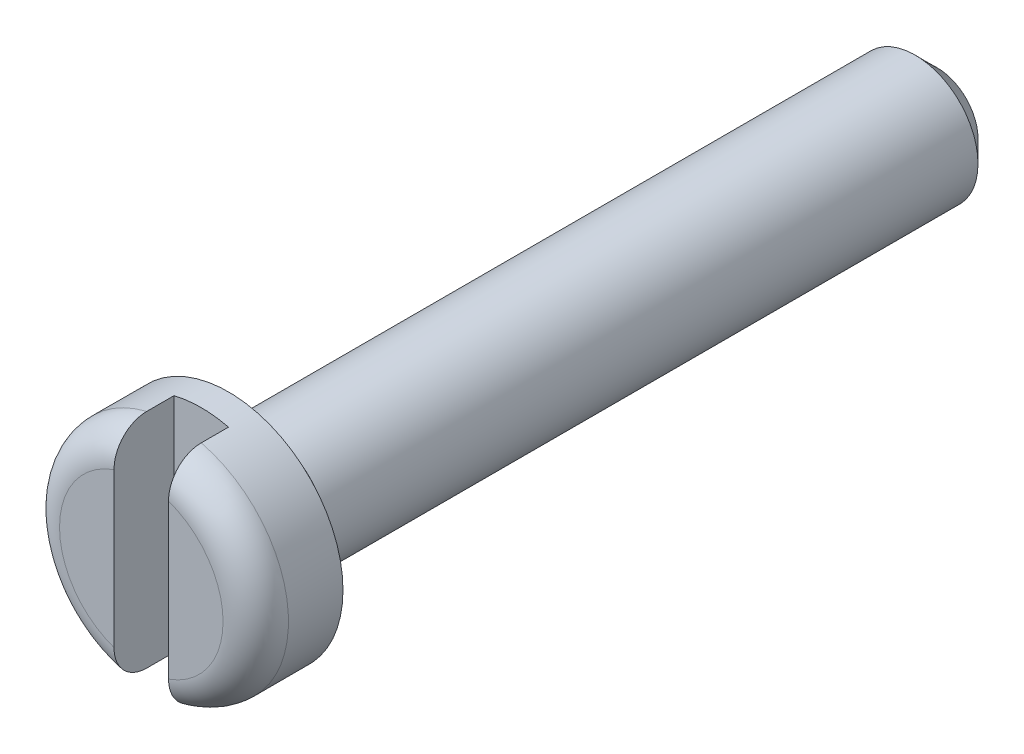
ISO-10303-21;
HEADER;
FILE_DESCRIPTION(('STEP AP214'),'2;1');
FILE_NAME('part.step','',(''),(''),'','','');
FILE_SCHEMA(('AUTOMOTIVE_DESIGN { 1 0 10303 214 1 1 1 1 }'));
ENDSEC;
DATA;
#1=APPLICATION_CONTEXT('core data for automotive mechanical design processes');
#2=APPLICATION_PROTOCOL_DEFINITION('international standard','automotive_design',2000,#1);
#3=PRODUCT_CONTEXT('',#1,'mechanical');
#4=PRODUCT('Part','Part','',(#3));
#5=PRODUCT_RELATED_PRODUCT_CATEGORY('part','',(#4));
#6=PRODUCT_DEFINITION_FORMATION('','',#4);
#7=PRODUCT_DEFINITION_CONTEXT('part definition',#1,'design');
#8=PRODUCT_DEFINITION('design','',#6,#7);
#9=PRODUCT_DEFINITION_SHAPE('','',#8);
#10=(LENGTH_UNIT() NAMED_UNIT(*) SI_UNIT(.MILLI.,.METRE.));
#11=(NAMED_UNIT(*) PLANE_ANGLE_UNIT() SI_UNIT($,.RADIAN.));
#12=(NAMED_UNIT(*) SI_UNIT($,.STERADIAN.) SOLID_ANGLE_UNIT());
#13=UNCERTAINTY_MEASURE_WITH_UNIT(LENGTH_MEASURE(1.E-05),#10,'distance_accuracy_value','');
#14=(GEOMETRIC_REPRESENTATION_CONTEXT(3) GLOBAL_UNCERTAINTY_ASSIGNED_CONTEXT((#13)) GLOBAL_UNIT_ASSIGNED_CONTEXT((#10,
#11,#12)) REPRESENTATION_CONTEXT('',''));
#15=CARTESIAN_POINT('',(0.,0.,0.));
#16=DIRECTION('',(0.,0.,1.));
#17=DIRECTION('',(1.,0.,0.));
#18=AXIS2_PLACEMENT_3D('',#15,#16,#17);
#19=CARTESIAN_POINT('',(0.,0.,1.6));
#20=DIRECTION('',(0.,0.,1.));
#21=DIRECTION('',(1.,0.,0.));
#22=AXIS2_PLACEMENT_3D('',#19,#20,#21);
#23=PLANE('',#22);
#24=DIRECTION('',(0.,-1.,0.));
#25=VECTOR('',#24,1.);
#26=CARTESIAN_POINT('',(-0.5,0.,1.6));
#27=LINE('',#26,#25);
#28=CARTESIAN_POINT('',(-0.5,1.4142135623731,1.6));
#29=VERTEX_POINT('',#28);
#30=CARTESIAN_POINT('',(-0.5,-1.4142135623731,1.6));
#31=VERTEX_POINT('',#30);
#32=EDGE_CURVE('E97',#29,#31,#27,.T.);
#33=ORIENTED_EDGE('',*,*,#32,.F.);
#34=CARTESIAN_POINT('',(0.,0.,1.6));
#35=DIRECTION('',(0.,0.,1.));
#36=DIRECTION('',(1.,0.,0.));
#37=AXIS2_PLACEMENT_3D('',#34,#35,#36);
#38=CIRCLE('',#37,1.5);
#39=EDGE_CURVE('E121',#29,#31,#38,.T.);
#40=ORIENTED_EDGE('',*,*,#39,.T.);
#41=EDGE_LOOP('',(#33,#40));
#42=FACE_BOUND('',#41,.T.);
#43=ADVANCED_FACE('F26',(#42),#23,.T.);
#44=CARTESIAN_POINT('',(0.,0.,1.));
#45=DIRECTION('',(0.,0.,1.));
#46=DIRECTION('',(1.,0.,0.));
#47=AXIS2_PLACEMENT_3D('',#44,#45,#46);
#48=TOROIDAL_SURFACE('',#47,1.5,0.6);
#49=CARTESIAN_POINT('',(-0.5,-1.99964689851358,1.21223347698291));
#50=CARTESIAN_POINT('',(-0.5,-2.01156673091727,1.18165302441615));
#51=CARTESIAN_POINT('',(-0.5,-2.02092214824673,1.15006159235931));
#52=CARTESIAN_POINT('',(-0.5,-2.03420012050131,1.08574395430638));
#53=CARTESIAN_POINT('',(-0.5,-2.03811994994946,1.05301718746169));
#54=CARTESIAN_POINT('',(-0.5,-2.04039563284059,0.987371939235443));
#55=CARTESIAN_POINT('',(-0.5,-2.03875192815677,0.954453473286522));
#56=CARTESIAN_POINT('',(-0.5,-2.02995378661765,0.889365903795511));
#57=CARTESIAN_POINT('',(-0.5,-2.02279989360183,0.857196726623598));
#58=CARTESIAN_POINT('',(-0.5,-2.00321865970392,0.794539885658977));
#59=CARTESIAN_POINT('',(-0.5,-1.99079615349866,0.764050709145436));
#60=CARTESIAN_POINT('',(-0.5,-1.96106630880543,0.705557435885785));
#61=CARTESIAN_POINT('',(-0.5,-1.94375877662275,0.677553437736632));
#62=CARTESIAN_POINT('',(-0.5,-1.90455349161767,0.6244526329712));
#63=CARTESIAN_POINT('',(-0.5,-1.88260363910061,0.599394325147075));
#64=CARTESIAN_POINT('',(-0.5,-1.83490308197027,0.553207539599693));
#65=CARTESIAN_POINT('',(-0.5,-1.80915201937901,0.532079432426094));
#66=CARTESIAN_POINT('',(-0.5,-1.75389034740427,0.493752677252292));
#67=CARTESIAN_POINT('',(-0.5,-1.7243002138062,0.476668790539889));
#68=CARTESIAN_POINT('',(-0.5,-1.66275438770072,0.447501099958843));
#69=CARTESIAN_POINT('',(-0.5,-1.63079832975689,0.435418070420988));
#70=CARTESIAN_POINT('',(-0.5,-1.56410675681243,0.416073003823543));
#71=CARTESIAN_POINT('',(-0.5,-1.52931144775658,0.409017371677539));
#72=CARTESIAN_POINT('',(-0.5,-1.45904380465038,0.400550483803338));
#73=CARTESIAN_POINT('',(-0.5,-1.42357131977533,0.399140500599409));
#74=CARTESIAN_POINT('',(-0.5,-1.35108451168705,0.401927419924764));
#75=CARTESIAN_POINT('',(-0.5,-1.31408104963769,0.406406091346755));
#76=CARTESIAN_POINT('',(-0.5,-1.24126423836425,0.421208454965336));
#77=CARTESIAN_POINT('',(-0.5,-1.20545115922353,0.431533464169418));
#78=CARTESIAN_POINT('',(-0.5,-1.13417944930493,0.458325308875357));
#79=CARTESIAN_POINT('',(-0.5,-1.09882466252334,0.475068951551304));
#80=CARTESIAN_POINT('',(-0.5,-1.0313298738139,0.514163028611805));
#81=CARTESIAN_POINT('',(-0.5,-0.999192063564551,0.536517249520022));
#82=CARTESIAN_POINT('',(-0.5,-0.938652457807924,0.586745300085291));
#83=CARTESIAN_POINT('',(-0.5,-0.91031989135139,0.614702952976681));
#84=CARTESIAN_POINT('',(-0.5,-0.859233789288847,0.675318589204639));
#85=CARTESIAN_POINT('',(-0.5,-0.836472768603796,0.707970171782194));
#86=CARTESIAN_POINT('',(-0.5,-0.802490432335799,0.768994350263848));
#87=CARTESIAN_POINT('',(-0.5,-0.789813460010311,0.796558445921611));
#88=CARTESIAN_POINT('',(-0.5,-0.769222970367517,0.853407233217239));
#89=CARTESIAN_POINT('',(-0.5,-0.761304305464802,0.882690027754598));
#90=CARTESIAN_POINT('',(-0.5,-0.750757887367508,0.942341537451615));
#91=CARTESIAN_POINT('',(-0.5,-0.74815377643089,0.972714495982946));
#92=CARTESIAN_POINT('',(-0.5,-0.748528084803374,1.03342787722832));
#93=CARTESIAN_POINT('',(-0.5,-0.751506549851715,1.06376829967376));
#94=CARTESIAN_POINT('',(-0.5,-0.762394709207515,1.12132246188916));
#95=CARTESIAN_POINT('',(-0.5,-0.769943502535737,1.14860616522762));
#96=CARTESIAN_POINT('',(-0.5,-0.789179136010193,1.20166601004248));
#97=CARTESIAN_POINT('',(-0.5,-0.800867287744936,1.22744167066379));
#98=CARTESIAN_POINT('',(-0.5,-0.82889681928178,1.27899767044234));
#99=CARTESIAN_POINT('',(-0.5,-0.845533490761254,1.30461659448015));
#100=CARTESIAN_POINT('',(-0.5,-0.882315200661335,1.35319089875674));
#101=CARTESIAN_POINT('',(-0.5,-0.902461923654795,1.37614499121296));
#102=CARTESIAN_POINT('',(-0.5,-0.949067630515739,1.42246367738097));
#103=CARTESIAN_POINT('',(-0.5,-0.976021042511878,1.44533169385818));
#104=CARTESIAN_POINT('',(-0.5,-1.03306909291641,1.48674639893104));
#105=CARTESIAN_POINT('',(-0.5,-1.0631653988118,1.50529077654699));
#106=CARTESIAN_POINT('',(-0.5,-1.1291001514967,1.53941199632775));
#107=CARTESIAN_POINT('',(-0.5,-1.16520935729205,1.55446871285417));
#108=CARTESIAN_POINT('',(-0.5,-1.23942611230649,1.57840607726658));
#109=CARTESIAN_POINT('',(-0.5,-1.27753394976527,1.58728583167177));
#110=CARTESIAN_POINT('',(-0.5,-1.35523785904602,1.59856860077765));
#111=CARTESIAN_POINT('',(-0.5,-1.39484711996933,1.60088192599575));
#112=CARTESIAN_POINT('',(-0.5,-1.47386106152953,1.59851603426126));
#113=CARTESIAN_POINT('',(-0.5,-1.51326578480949,1.59383833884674));
#114=CARTESIAN_POINT('',(-0.5,-1.58894762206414,1.57778917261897));
#115=CARTESIAN_POINT('',(-0.5,-1.62528651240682,1.56670972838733));
#116=CARTESIAN_POINT('',(-0.5,-1.69542326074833,1.5382626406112));
#117=CARTESIAN_POINT('',(-0.5,-1.72922156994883,1.52089611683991));
#118=CARTESIAN_POINT('',(-0.5,-1.79139186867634,1.48138259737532));
#119=CARTESIAN_POINT('',(-0.5,-1.81995682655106,1.45953887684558));
#120=CARTESIAN_POINT('',(-0.5,-1.87278431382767,1.41117493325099));
#121=CARTESIAN_POINT('',(-0.5,-1.89705092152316,1.38465919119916));
#122=CARTESIAN_POINT('',(-0.5,-1.93549452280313,1.33423884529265));
#123=CARTESIAN_POINT('',(-0.5,-1.95071039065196,1.31111809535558));
#124=CARTESIAN_POINT('',(-0.5,-1.97777146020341,1.26298118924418));
#125=CARTESIAN_POINT('',(-0.5,-1.9896170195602,1.23796523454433));
#126=CARTESIAN_POINT('',(-0.5,-1.99964689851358,1.21223347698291));
#127=B_SPLINE_CURVE_WITH_KNOTS('',3,(#49,#50,#51,#52,#53,#54,#55,#56,#57,#58,#59,#60,#61,#62,
#63,#64,#65,#66,#67,#68,#69,#70,#71,#72,#73,#74,#75,#76,#77,#78,#79,#80,#81,#82,#83,#84,#85,#86,
#87,#88,#89,#90,#91,#92,#93,#94,#95,#96,#97,#98,#99,#100,#101,#102,#103,#104,#105,#106,#107,
#108,#109,#110,#111,#112,#113,#114,#115,#116,#117,#118,#119,#120,#121,#122,#123,#124,#125,#126),
.UNSPECIFIED.,.T.,.F.,(4,2,2,2,2,2,2,2,2,2,2,2,2,2,2,2,2,2,2,2,2,2,2,2,2,2,2,2,2,2,2,2,2,2,2,2,
2,2,4),(0.,0.0983660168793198,0.196781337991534,0.295188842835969,0.393586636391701,
0.491894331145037,0.590205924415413,0.689685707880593,0.789174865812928,0.89121730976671,
0.993275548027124,1.09931419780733,1.20537674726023,1.31670366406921,1.42805566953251,
1.54487799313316,1.66177937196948,1.78058119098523,1.89922251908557,1.98986685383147,
2.08041295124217,2.17136098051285,2.26230975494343,2.34687306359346,2.4314631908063,
2.52275501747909,2.61409077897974,2.71970201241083,2.8253695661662,2.94219498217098,
3.05903729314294,3.17746802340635,3.29587298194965,3.4092608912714,3.52262861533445,
3.62996855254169,3.73720609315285,3.8199844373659,3.90275399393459),.UNSPECIFIED.);
#128=CARTESIAN_POINT('',(-0.5,-2.03960780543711,1.));
#129=VERTEX_POINT('',#128);
#130=EDGE_CURVE('E49',#31,#129,#127,.T.);
#131=ORIENTED_EDGE('',*,*,#130,.F.);
#132=ORIENTED_EDGE('',*,*,#39,.F.);
#133=CARTESIAN_POINT('',(-0.5,0.772599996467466,1.15466697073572));
#134=CARTESIAN_POINT('',(-0.5,0.763899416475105,1.12728531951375));
#135=CARTESIAN_POINT('',(-0.5,0.757412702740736,1.09919049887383));
#136=CARTESIAN_POINT('',(-0.5,0.749307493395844,1.04230286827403));
#137=CARTESIAN_POINT('',(-0.5,0.747687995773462,1.01351020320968));
#138=CARTESIAN_POINT('',(-0.5,0.749438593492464,0.956074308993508));
#139=CARTESIAN_POINT('',(-0.5,0.752809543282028,0.927431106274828));
#140=CARTESIAN_POINT('',(-0.5,0.764293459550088,0.871113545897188));
#141=CARTESIAN_POINT('',(-0.5,0.772408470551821,0.843439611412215));
#142=CARTESIAN_POINT('',(-0.5,0.792942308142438,0.789539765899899));
#143=CARTESIAN_POINT('',(-0.5,0.805390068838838,0.763324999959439));
#144=CARTESIAN_POINT('',(-0.5,0.833977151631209,0.713002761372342));
#145=CARTESIAN_POINT('',(-0.5,0.850117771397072,0.688896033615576));
#146=CARTESIAN_POINT('',(-0.5,0.888019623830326,0.639886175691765));
#147=CARTESIAN_POINT('',(-0.5,0.910252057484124,0.615347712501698));
#148=CARTESIAN_POINT('',(-0.5,0.958060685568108,0.569779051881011));
#149=CARTESIAN_POINT('',(-0.5,0.983638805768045,0.548750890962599));
#150=CARTESIAN_POINT('',(-0.5,1.04127151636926,0.507845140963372));
#151=CARTESIAN_POINT('',(-0.5,1.07373186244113,0.488536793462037));
#152=CARTESIAN_POINT('',(-0.5,1.14130979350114,0.455312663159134));
#153=CARTESIAN_POINT('',(-0.5,1.17642828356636,0.441398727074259));
#154=CARTESIAN_POINT('',(-0.5,1.25038064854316,0.418775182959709));
#155=CARTESIAN_POINT('',(-0.5,1.28931277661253,0.410384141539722));
#156=CARTESIAN_POINT('',(-0.5,1.36804626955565,0.400426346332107));
#157=CARTESIAN_POINT('',(-0.5,1.4078475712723,0.398859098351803));
#158=CARTESIAN_POINT('',(-0.5,1.4861656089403,0.402738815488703));
#159=CARTESIAN_POINT('',(-0.5,1.52469038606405,0.408019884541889));
#160=CARTESIAN_POINT('',(-0.5,1.60019331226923,0.425342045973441));
#161=CARTESIAN_POINT('',(-0.5,1.63717190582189,0.43738118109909));
#162=CARTESIAN_POINT('',(-0.5,1.70644533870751,0.467196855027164));
#163=CARTESIAN_POINT('',(-0.5,1.7388841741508,0.484638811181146));
#164=CARTESIAN_POINT('',(-0.5,1.80016448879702,0.524989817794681));
#165=CARTESIAN_POINT('',(-0.5,1.8290070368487,0.547897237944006));
#166=CARTESIAN_POINT('',(-0.5,1.88077906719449,0.597293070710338));
#167=CARTESIAN_POINT('',(-0.5,1.903929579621,0.623549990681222));
#168=CARTESIAN_POINT('',(-0.5,1.94529912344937,0.679698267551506));
#169=CARTESIAN_POINT('',(-0.5,1.96351923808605,0.709588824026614));
#170=CARTESIAN_POINT('',(-0.5,1.99385821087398,0.771009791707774));
#171=CARTESIAN_POINT('',(-0.5,2.00616950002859,0.802445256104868));
#172=CARTESIAN_POINT('',(-0.5,2.02521830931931,0.866961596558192));
#173=CARTESIAN_POINT('',(-0.5,2.03195656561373,0.900042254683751));
#174=CARTESIAN_POINT('',(-0.5,2.0395595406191,0.966200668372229));
#175=CARTESIAN_POINT('',(-0.5,2.04053875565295,0.999265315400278));
#176=CARTESIAN_POINT('',(-0.5,2.03689912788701,1.06508385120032));
#177=CARTESIAN_POINT('',(-0.5,2.03228058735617,1.09783775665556));
#178=CARTESIAN_POINT('',(-0.5,2.01763364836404,1.16192635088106));
#179=CARTESIAN_POINT('',(-0.5,2.00763426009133,1.19326768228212));
#180=CARTESIAN_POINT('',(-0.5,1.98255923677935,1.25384696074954));
#181=CARTESIAN_POINT('',(-0.5,1.96748352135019,1.28308487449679));
#182=CARTESIAN_POINT('',(-0.5,1.93256863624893,1.33891428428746));
#183=CARTESIAN_POINT('',(-0.5,1.91268930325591,1.36548063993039));
#184=CARTESIAN_POINT('',(-0.5,1.86884253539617,1.41498884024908));
#185=CARTESIAN_POINT('',(-0.5,1.84487477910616,1.43793039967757));
#186=CARTESIAN_POINT('',(-0.5,1.79297405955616,1.48010891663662));
#187=CARTESIAN_POINT('',(-0.5,1.76496410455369,1.49925105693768));
#188=CARTESIAN_POINT('',(-0.5,1.70621840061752,1.53274771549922));
#189=CARTESIAN_POINT('',(-0.5,1.6754822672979,1.547101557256));
#190=CARTESIAN_POINT('',(-0.5,1.61098629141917,1.57118610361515));
#191=CARTESIAN_POINT('',(-0.5,1.5771574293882,1.58073177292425));
#192=CARTESIAN_POINT('',(-0.5,1.50841164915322,1.59428924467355));
#193=CARTESIAN_POINT('',(-0.5,1.47349450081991,1.59829986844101));
#194=CARTESIAN_POINT('',(-0.5,1.40179301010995,1.60088611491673));
#195=CARTESIAN_POINT('',(-0.5,1.364999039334,1.59919340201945));
#196=CARTESIAN_POINT('',(-0.5,1.29215404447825,1.58997004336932));
#197=CARTESIAN_POINT('',(-0.5,1.25610316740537,1.58243825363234));
#198=CARTESIAN_POINT('',(-0.5,1.18382026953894,1.56130965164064));
#199=CARTESIAN_POINT('',(-0.5,1.14767284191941,1.54742301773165));
#200=CARTESIAN_POINT('',(-0.5,1.07809474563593,1.51394463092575));
#201=CARTESIAN_POINT('',(-0.5,1.04466605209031,1.49434877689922));
#202=CARTESIAN_POINT('',(-0.5,0.980565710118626,1.44927309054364));
#203=CARTESIAN_POINT('',(-0.5,0.950002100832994,1.42363913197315));
#204=CARTESIAN_POINT('',(-0.5,0.893903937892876,1.36737392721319));
#205=CARTESIAN_POINT('',(-0.5,0.868362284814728,1.33674984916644));
#206=CARTESIAN_POINT('',(-0.5,0.830295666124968,1.28098262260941));
#207=CARTESIAN_POINT('',(-0.5,0.816160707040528,1.25693018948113));
#208=CARTESIAN_POINT('',(-0.5,0.791526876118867,1.2070295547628));
#209=CARTESIAN_POINT('',(-0.5,0.7810254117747,1.18118264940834));
#210=CARTESIAN_POINT('',(-0.5,0.772599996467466,1.15466697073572));
#211=B_SPLINE_CURVE_WITH_KNOTS('',3,(#133,#134,#135,#136,#137,#138,#139,#140,#141,#142,#143,
#144,#145,#146,#147,#148,#149,#150,#151,#152,#153,#154,#155,#156,#157,#158,#159,#160,#161,#162,
#163,#164,#165,#166,#167,#168,#169,#170,#171,#172,#173,#174,#175,#176,#177,#178,#179,#180,#181,
#182,#183,#184,#185,#186,#187,#188,#189,#190,#191,#192,#193,#194,#195,#196,#197,#198,#199,#200,
#201,#202,#203,#204,#205,#206,#207,#208,#209,#210),.UNSPECIFIED.,.T.,.F.,(4,2,2,2,2,2,2,2,2,2,2,
2,2,2,2,2,2,2,2,2,2,2,2,2,2,2,2,2,2,2,2,2,2,2,2,2,2,2,4),(0.,0.0861004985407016,
0.172183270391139,0.258280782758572,0.344415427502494,0.431136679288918,0.517888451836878,
0.616838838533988,0.715846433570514,0.828658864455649,0.94150988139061,1.06040365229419,
1.17928881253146,1.29534715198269,1.41137189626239,1.52130225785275,1.63119986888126,
1.73569320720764,1.84016356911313,1.94095132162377,2.04172575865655,2.14048972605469,
2.23924836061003,2.33747980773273,2.43571281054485,2.5347974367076,2.63388985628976,
2.73520870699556,2.83654186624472,2.94152301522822,3.0465265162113,3.1565379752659,
3.26657099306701,3.38221768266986,3.49794765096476,3.61703308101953,3.7359489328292,
3.81938607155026,3.90276355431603),.UNSPECIFIED.);
#212=CARTESIAN_POINT('',(-0.5,2.03960780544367,0.999999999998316));
#213=VERTEX_POINT('',#212);
#214=EDGE_CURVE('E158',#213,#29,#211,.T.);
#215=ORIENTED_EDGE('',*,*,#214,.F.);
#216=CARTESIAN_POINT('',(0.,0.,1.));
#217=DIRECTION('',(0.,0.,1.));
#218=DIRECTION('',(1.,0.,0.));
#219=AXIS2_PLACEMENT_3D('',#216,#217,#218);
#220=CIRCLE('',#219,2.1);
#221=EDGE_CURVE('E123',#129,#213,#220,.F.);
#222=ORIENTED_EDGE('',*,*,#221,.F.);
#223=EDGE_LOOP('',(#131,#132,#215,#222));
#224=FACE_BOUND('',#223,.T.);
#225=ADVANCED_FACE('F173',(#224),#48,.T.);
#226=CARTESIAN_POINT('',(0.,0.,0.));
#227=DIRECTION('',(0.,0.,1.));
#228=DIRECTION('',(1.,0.,0.));
#229=AXIS2_PLACEMENT_3D('',#226,#227,#228);
#230=PLANE('',#229);
#231=CARTESIAN_POINT('',(0.,0.,0.));
#232=DIRECTION('',(0.,0.,1.));
#233=DIRECTION('',(1.,0.,0.));
#234=AXIS2_PLACEMENT_3D('',#231,#232,#233);
#235=CIRCLE('',#234,2.1);
#236=CARTESIAN_POINT('',(2.1,0.,0.));
#237=VERTEX_POINT('',#236);
#238=EDGE_CURVE('E115',#237,#237,#235,.T.);
#239=ORIENTED_EDGE('',*,*,#238,.F.);
#240=EDGE_LOOP('',(#239));
#241=FACE_BOUND('',#240,.T.);
#242=CARTESIAN_POINT('',(0.,0.,0.));
#243=DIRECTION('',(0.,0.,1.));
#244=DIRECTION('',(1.,0.,0.));
#245=AXIS2_PLACEMENT_3D('',#242,#243,#244);
#246=CIRCLE('',#245,0.749999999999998);
#247=CARTESIAN_POINT('',(0.749999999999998,0.,0.));
#248=VERTEX_POINT('',#247);
#249=EDGE_CURVE('E108',#248,#248,#246,.T.);
#250=ORIENTED_EDGE('',*,*,#249,.T.);
#251=EDGE_LOOP('',(#250));
#252=FACE_BOUND('',#251,.T.);
#253=ADVANCED_FACE('F182',(#241,#252),#230,.F.);
#254=CARTESIAN_POINT('',(0.,0.,1.6));
#255=DIRECTION('',(0.,0.,-1.));
#256=DIRECTION('',(-1.,0.,0.));
#257=AXIS2_PLACEMENT_3D('',#254,#255,#256);
#258=CYLINDRICAL_SURFACE('',#257,2.1);
#259=CARTESIAN_POINT('',(0.,0.,0.5));
#260=DIRECTION('',(0.,0.,-1.));
#261=DIRECTION('',(-1.,0.,0.));
#262=AXIS2_PLACEMENT_3D('',#259,#260,#261);
#263=CIRCLE('',#262,2.1);
#264=CARTESIAN_POINT('',(0.499999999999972,-2.03960780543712,0.5));
#265=VERTEX_POINT('',#264);
#266=CARTESIAN_POINT('',(-0.5,-2.03960780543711,0.5));
#267=VERTEX_POINT('',#266);
#268=EDGE_CURVE('E11',#265,#267,#263,.T.);
#269=ORIENTED_EDGE('',*,*,#268,.T.);
#270=DIRECTION('',(0.,0.,-1.));
#271=VECTOR('',#270,1.);
#272=CARTESIAN_POINT('',(-0.5,-2.03960780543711,1.6));
#273=LINE('',#272,#271);
#274=EDGE_CURVE('E106',#267,#129,#273,.F.);
#275=ORIENTED_EDGE('',*,*,#274,.T.);
#276=ORIENTED_EDGE('',*,*,#221,.T.);
#277=DIRECTION('',(0.,0.,-1.));
#278=VECTOR('',#277,1.);
#279=CARTESIAN_POINT('',(-0.5,2.03960780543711,1.6));
#280=LINE('',#279,#278);
#281=CARTESIAN_POINT('',(-0.5,2.03960780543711,0.5));
#282=VERTEX_POINT('',#281);
#283=EDGE_CURVE('E99',#213,#282,#280,.T.);
#284=ORIENTED_EDGE('',*,*,#283,.T.);
#285=CARTESIAN_POINT('',(0.499999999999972,2.03960780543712,0.5));
#286=VERTEX_POINT('',#285);
#287=EDGE_CURVE('E30',#282,#286,#263,.T.);
#288=ORIENTED_EDGE('',*,*,#287,.T.);
#289=DIRECTION('',(0.,0.,-1.));
#290=VECTOR('',#289,1.);
#291=CARTESIAN_POINT('',(0.499999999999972,2.03960780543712,1.6));
#292=LINE('',#291,#290);
#293=CARTESIAN_POINT('',(0.499999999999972,2.0396078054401,1.00000000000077));
#294=VERTEX_POINT('',#293);
#295=EDGE_CURVE('E91',#286,#294,#292,.F.);
#296=ORIENTED_EDGE('',*,*,#295,.T.);
#297=CARTESIAN_POINT('',(0.499999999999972,-2.03960780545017,1.00000000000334));
#298=VERTEX_POINT('',#297);
#299=EDGE_CURVE('E96',#294,#298,#220,.F.);
#300=ORIENTED_EDGE('',*,*,#299,.T.);
#301=DIRECTION('',(0.,0.,-1.));
#302=VECTOR('',#301,1.);
#303=CARTESIAN_POINT('',(0.499999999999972,-2.03960780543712,1.6));
#304=LINE('',#303,#302);
#305=EDGE_CURVE('E88',#298,#265,#304,.T.);
#306=ORIENTED_EDGE('',*,*,#305,.T.);
#307=EDGE_LOOP('',(#269,#275,#276,#284,#288,#296,#300,#306));
#308=FACE_BOUND('',#307,.T.);
#309=ORIENTED_EDGE('',*,*,#238,.T.);
#310=EDGE_LOOP('',(#309));
#311=FACE_BOUND('',#310,.T.);
#312=ADVANCED_FACE('F28',(#308,#311),#258,.T.);
#313=DIRECTION('',(0.,1.,0.));
#314=VECTOR('',#313,1.);
#315=CARTESIAN_POINT('',(0.499999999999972,0.,1.6));
#316=LINE('',#315,#314);
#317=CARTESIAN_POINT('',(0.499999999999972,-1.41421356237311,1.6));
#318=VERTEX_POINT('',#317);
#319=CARTESIAN_POINT('',(0.499999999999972,1.41421356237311,1.6));
#320=VERTEX_POINT('',#319);
#321=EDGE_CURVE('E41',#318,#320,#316,.T.);
#322=ORIENTED_EDGE('',*,*,#321,.F.);
#323=EDGE_CURVE('E118',#318,#320,#38,.T.);
#324=ORIENTED_EDGE('',*,*,#323,.T.);
#325=EDGE_LOOP('',(#322,#324));
#326=FACE_BOUND('',#325,.T.);
#327=ADVANCED_FACE('F168',(#326),#23,.T.);
#328=CARTESIAN_POINT('',(0.499999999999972,-1.99964689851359,1.21223347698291));
#329=CARTESIAN_POINT('',(0.499999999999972,-1.98743987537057,1.24354459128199));
#330=CARTESIAN_POINT('',(0.499999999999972,-1.97253379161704,1.27382239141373));
#331=CARTESIAN_POINT('',(0.499999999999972,-1.93780309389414,1.33143351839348));
#332=CARTESIAN_POINT('',(0.499999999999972,-1.9179739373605,1.35876409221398));
#333=CARTESIAN_POINT('',(0.499999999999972,-1.87405915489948,1.40968880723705));
#334=CARTESIAN_POINT('',(0.499999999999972,-1.84997959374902,1.43328818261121));
#335=CARTESIAN_POINT('',(0.499999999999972,-1.79828051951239,1.47620474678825));
#336=CARTESIAN_POINT('',(0.499999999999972,-1.77066148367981,1.49552251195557));
#337=CARTESIAN_POINT('',(0.499999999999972,-1.7120482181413,1.52982219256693));
#338=CARTESIAN_POINT('',(0.499999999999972,-1.68099392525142,1.54470133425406));
#339=CARTESIAN_POINT('',(0.499999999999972,-1.61689891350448,1.56926953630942));
#340=CARTESIAN_POINT('',(0.499999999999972,-1.58385781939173,1.57895761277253));
#341=CARTESIAN_POINT('',(0.499999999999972,-1.51525349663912,1.59331938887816));
#342=CARTESIAN_POINT('',(0.499999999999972,-1.47964263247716,1.5977651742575));
#343=CARTESIAN_POINT('',(0.499999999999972,-1.40817028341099,1.60092494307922));
#344=CARTESIAN_POINT('',(0.499999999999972,-1.3723087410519,1.59963756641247));
#345=CARTESIAN_POINT('',(0.499999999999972,-1.29940747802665,1.59129248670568));
#346=CARTESIAN_POINT('',(0.499999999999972,-1.2624010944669,1.58394350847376));
#347=CARTESIAN_POINT('',(0.499999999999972,-1.19004120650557,1.56341749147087));
#348=CARTESIAN_POINT('',(0.499999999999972,-1.15468811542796,1.55023900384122));
#349=CARTESIAN_POINT('',(0.499999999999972,-1.08496478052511,1.51771878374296));
#350=CARTESIAN_POINT('',(0.499999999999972,-1.05071211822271,1.49812429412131));
#351=CARTESIAN_POINT('',(0.499999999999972,-0.985940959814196,1.45345777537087));
#352=CARTESIAN_POINT('',(0.499999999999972,-0.955425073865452,1.42838195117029));
#353=CARTESIAN_POINT('',(0.499999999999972,-0.899227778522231,1.37328702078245));
#354=CARTESIAN_POINT('',(0.499999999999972,-0.873544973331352,1.343269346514));
#355=CARTESIAN_POINT('',(0.499999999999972,-0.828311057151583,1.27893305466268));
#356=CARTESIAN_POINT('',(0.499999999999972,-0.808748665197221,1.24462251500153));
#357=CARTESIAN_POINT('',(0.499999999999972,-0.781215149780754,1.18183443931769));
#358=CARTESIAN_POINT('',(0.499999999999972,-0.771561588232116,1.15409131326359));
#359=CARTESIAN_POINT('',(0.499999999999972,-0.757044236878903,1.09738531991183));
#360=CARTESIAN_POINT('',(0.499999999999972,-0.752175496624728,1.06842374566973));
#361=CARTESIAN_POINT('',(0.499999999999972,-0.747573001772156,1.01001561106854));
#362=CARTESIAN_POINT('',(0.499999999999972,-0.747852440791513,0.980567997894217));
#363=CARTESIAN_POINT('',(0.499999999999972,-0.753556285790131,0.922172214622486));
#364=CARTESIAN_POINT('',(0.499999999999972,-0.758982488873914,0.893224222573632));
#365=CARTESIAN_POINT('',(0.499999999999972,-0.774320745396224,0.83760124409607));
#366=CARTESIAN_POINT('',(0.499999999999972,-0.784077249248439,0.810882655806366));
#367=CARTESIAN_POINT('',(0.499999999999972,-0.807486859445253,0.759220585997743));
#368=CARTESIAN_POINT('',(0.499999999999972,-0.821141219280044,0.734277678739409));
#369=CARTESIAN_POINT('',(0.499999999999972,-0.853512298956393,0.683857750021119));
#370=CARTESIAN_POINT('',(0.499999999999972,-0.872625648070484,0.658636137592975));
#371=CARTESIAN_POINT('',(0.499999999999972,-0.91428764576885,0.611215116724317));
#372=CARTESIAN_POINT('',(0.499999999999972,-0.936838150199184,0.589017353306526));
#373=CARTESIAN_POINT('',(0.499999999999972,-0.988450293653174,0.544789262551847));
#374=CARTESIAN_POINT('',(0.499999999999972,-1.01798027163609,0.523303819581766));
#375=CARTESIAN_POINT('',(0.499999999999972,-1.08000274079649,0.48513885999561));
#376=CARTESIAN_POINT('',(0.499999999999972,-1.11249658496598,0.468461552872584));
#377=CARTESIAN_POINT('',(0.499999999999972,-1.18244746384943,0.43913396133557));
#378=CARTESIAN_POINT('',(0.499999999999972,-1.22009278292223,0.426929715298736));
#379=CARTESIAN_POINT('',(0.499999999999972,-1.2969086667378,0.409044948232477));
#380=CARTESIAN_POINT('',(0.499999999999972,-1.33607929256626,0.403364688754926));
#381=CARTESIAN_POINT('',(0.499999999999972,-1.41461638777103,0.39886821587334));
#382=CARTESIAN_POINT('',(0.499999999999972,-1.45398075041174,0.40001613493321));
#383=CARTESIAN_POINT('',(0.499999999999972,-1.53189117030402,0.409254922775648));
#384=CARTESIAN_POINT('',(0.499999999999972,-1.5704374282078,0.417344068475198));
#385=CARTESIAN_POINT('',(0.499999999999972,-1.64360296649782,0.439836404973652));
#386=CARTESIAN_POINT('',(0.499999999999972,-1.6783220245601,0.453914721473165));
#387=CARTESIAN_POINT('',(0.499999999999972,-1.74471135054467,0.488013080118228));
#388=CARTESIAN_POINT('',(0.499999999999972,-1.77638256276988,0.508031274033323));
#389=CARTESIAN_POINT('',(0.499999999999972,-1.83402641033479,0.552297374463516));
#390=CARTESIAN_POINT('',(0.499999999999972,-1.86020981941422,0.576270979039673));
#391=CARTESIAN_POINT('',(0.499999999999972,-1.90797174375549,0.628434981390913));
#392=CARTESIAN_POINT('',(0.499999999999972,-1.92955149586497,0.656624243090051));
#393=CARTESIAN_POINT('',(0.499999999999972,-1.96660576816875,0.715192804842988));
#394=CARTESIAN_POINT('',(0.499999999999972,-1.98228949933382,0.745439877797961));
#395=CARTESIAN_POINT('',(0.499999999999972,-2.00821188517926,0.808190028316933));
#396=CARTESIAN_POINT('',(0.499999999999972,-2.01845051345,0.840693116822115));
#397=CARTESIAN_POINT('',(0.499999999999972,-2.03295846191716,0.90617517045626));
#398=CARTESIAN_POINT('',(0.499999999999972,-2.03736630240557,0.939123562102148));
#399=CARTESIAN_POINT('',(0.499999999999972,-2.0405221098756,1.00527080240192));
#400=CARTESIAN_POINT('',(0.499999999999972,-2.03927514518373,1.03846940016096));
#401=CARTESIAN_POINT('',(0.499999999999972,-2.03225879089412,1.09541705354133));
#402=CARTESIAN_POINT('',(0.499999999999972,-2.02777898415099,1.11933323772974));
#403=CARTESIAN_POINT('',(0.499999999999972,-2.01588525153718,1.16642410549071));
#404=CARTESIAN_POINT('',(0.499999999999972,-2.00847131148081,1.18959878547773));
#405=CARTESIAN_POINT('',(0.499999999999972,-1.99964689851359,1.21223347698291));
#406=B_SPLINE_CURVE_WITH_KNOTS('',3,(#328,#329,#330,#331,#332,#333,#334,#335,#336,#337,#338,
#339,#340,#341,#342,#343,#344,#345,#346,#347,#348,#349,#350,#351,#352,#353,#354,#355,#356,#357,
#358,#359,#360,#361,#362,#363,#364,#365,#366,#367,#368,#369,#370,#371,#372,#373,#374,#375,#376,
#377,#378,#379,#380,#381,#382,#383,#384,#385,#386,#387,#388,#389,#390,#391,#392,#393,#394,#395,
#396,#397,#398,#399,#400,#401,#402,#403,#404,#405),.UNSPECIFIED.,.T.,.F.,(4,2,2,2,2,2,2,2,2,2,2,
2,2,2,2,2,2,2,2,2,2,2,2,2,2,2,2,2,2,2,2,2,2,2,2,2,2,2,4),(0.,0.100729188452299,0.20155166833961,
0.302231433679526,0.402897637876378,0.505740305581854,0.608602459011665,0.715788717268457,
0.823000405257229,0.93568629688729,1.04840021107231,1.16623380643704,1.28414924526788,
1.40203057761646,1.51969333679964,1.60744527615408,1.69510633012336,1.78299207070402,
1.87090850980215,1.95589454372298,2.04090793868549,2.13548221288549,2.23010773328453,
2.33920605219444,2.44835442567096,2.56651235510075,2.68467502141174,2.80221754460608,
2.91973089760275,3.03155121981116,3.14333678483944,3.24930546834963,3.35524564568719,
3.45695959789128,3.55867404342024,3.65792589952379,3.75708881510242,3.82990522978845,
3.90272199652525),.UNSPECIFIED.);
#407=EDGE_CURVE('E138',#298,#318,#406,.T.);
#408=ORIENTED_EDGE('',*,*,#407,.F.);
#409=ORIENTED_EDGE('',*,*,#299,.F.);
#410=CARTESIAN_POINT('',(0.499999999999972,0.772599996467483,1.15466697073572));
#411=CARTESIAN_POINT('',(0.499999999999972,0.782909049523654,1.18709959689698));
#412=CARTESIAN_POINT('',(0.499999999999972,0.79633925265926,1.21857276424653));
#413=CARTESIAN_POINT('',(0.499999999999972,0.82848953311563,1.2787296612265));
#414=CARTESIAN_POINT('',(0.499999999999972,0.847223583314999,1.30740575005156));
#415=CARTESIAN_POINT('',(0.499999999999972,0.888891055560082,1.36119613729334));
#416=CARTESIAN_POINT('',(0.499999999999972,0.911795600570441,1.38633294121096));
#417=CARTESIAN_POINT('',(0.499999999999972,0.961086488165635,1.43287497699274));
#418=CARTESIAN_POINT('',(0.499999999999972,0.987471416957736,1.45428171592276));
#419=CARTESIAN_POINT('',(0.499999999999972,1.04617898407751,1.49522998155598));
#420=CARTESIAN_POINT('',(0.499999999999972,1.07883567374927,1.51429397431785));
#421=CARTESIAN_POINT('',(0.499999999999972,1.14677260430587,1.54699700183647));
#422=CARTESIAN_POINT('',(0.499999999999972,1.18205401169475,1.56063360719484));
#423=CARTESIAN_POINT('',(0.499999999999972,1.25625262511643,1.58263840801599));
#424=CARTESIAN_POINT('',(0.499999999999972,1.29526347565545,1.59069342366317));
#425=CARTESIAN_POINT('',(0.499999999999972,1.37409573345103,1.59996038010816));
#426=CARTESIAN_POINT('',(0.499999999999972,1.41391707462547,1.60117287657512));
#427=CARTESIAN_POINT('',(0.499999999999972,1.4921571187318,1.59658576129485));
#428=CARTESIAN_POINT('',(0.499999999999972,1.53058592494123,1.59096156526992));
#429=CARTESIAN_POINT('',(0.499999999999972,1.60583662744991,1.57297418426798));
#430=CARTESIAN_POINT('',(0.499999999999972,1.64265900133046,1.56061301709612));
#431=CARTESIAN_POINT('',(0.499999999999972,1.71156615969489,1.53020584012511));
#432=CARTESIAN_POINT('',(0.499999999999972,1.74379837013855,1.5124939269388));
#433=CARTESIAN_POINT('',(0.499999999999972,1.80462230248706,1.47164539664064));
#434=CARTESIAN_POINT('',(0.499999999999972,1.83321508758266,1.44851036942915));
#435=CARTESIAN_POINT('',(0.499999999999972,1.88447392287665,1.39871303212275));
#436=CARTESIAN_POINT('',(0.499999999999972,1.90736138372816,1.37227846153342));
#437=CARTESIAN_POINT('',(0.499999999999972,1.94818007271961,1.31582485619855));
#438=CARTESIAN_POINT('',(0.499999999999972,1.9661123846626,1.28580660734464));
#439=CARTESIAN_POINT('',(0.499999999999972,1.99587773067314,1.22417562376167));
#440=CARTESIAN_POINT('',(0.499999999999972,2.00790158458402,1.19265494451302));
#441=CARTESIAN_POINT('',(0.499999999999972,2.02636751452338,1.12801920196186));
#442=CARTESIAN_POINT('',(0.499999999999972,2.03281031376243,1.094904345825));
#443=CARTESIAN_POINT('',(0.499999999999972,2.03983162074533,1.02871633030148));
#444=CARTESIAN_POINT('',(0.499999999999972,2.04052240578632,0.995655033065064));
#445=CARTESIAN_POINT('',(0.499999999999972,2.03631277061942,0.929891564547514));
#446=CARTESIAN_POINT('',(0.499999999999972,2.03141264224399,0.897189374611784));
#447=CARTESIAN_POINT('',(0.499999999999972,2.01621692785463,0.833237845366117));
#448=CARTESIAN_POINT('',(0.499999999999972,2.0059483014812,0.801982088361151));
#449=CARTESIAN_POINT('',(0.499999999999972,1.98035462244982,0.74161664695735));
#450=CARTESIAN_POINT('',(0.499999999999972,1.96502948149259,0.712507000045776));
#451=CARTESIAN_POINT('',(0.499999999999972,1.92963437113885,0.656963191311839));
#452=CARTESIAN_POINT('',(0.499999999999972,1.90952283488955,0.630555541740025));
#453=CARTESIAN_POINT('',(0.499999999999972,1.8652422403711,0.581399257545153));
#454=CARTESIAN_POINT('',(0.499999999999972,1.84107285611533,0.558650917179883));
#455=CARTESIAN_POINT('',(0.499999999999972,1.78879110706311,0.516883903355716));
#456=CARTESIAN_POINT('',(0.499999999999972,1.76060135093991,0.497962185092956));
#457=CARTESIAN_POINT('',(0.499999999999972,1.70153489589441,0.464930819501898));
#458=CARTESIAN_POINT('',(0.499999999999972,1.67065781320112,0.450821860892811));
#459=CARTESIAN_POINT('',(0.499999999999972,1.60590615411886,0.427249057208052));
#460=CARTESIAN_POINT('',(0.499999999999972,1.57196342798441,0.417972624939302));
#461=CARTESIAN_POINT('',(0.499999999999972,1.50303470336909,0.404966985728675));
#462=CARTESIAN_POINT('',(0.499999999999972,1.46804848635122,0.401238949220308));
#463=CARTESIAN_POINT('',(0.499999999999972,1.39624353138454,0.39923717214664));
#464=CARTESIAN_POINT('',(0.499999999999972,1.35941731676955,0.401233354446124));
#465=CARTESIAN_POINT('',(0.499999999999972,1.28655576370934,0.411065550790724));
#466=CARTESIAN_POINT('',(0.499999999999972,1.25052060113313,0.418902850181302));
#467=CARTESIAN_POINT('',(0.499999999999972,1.17832282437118,0.440653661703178));
#468=CARTESIAN_POINT('',(0.499999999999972,1.14224717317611,0.454856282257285));
#469=CARTESIAN_POINT('',(0.499999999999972,1.07287071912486,0.488955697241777));
#470=CARTESIAN_POINT('',(0.499999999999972,1.03957162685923,0.508855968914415));
#471=CARTESIAN_POINT('',(0.499999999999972,0.975836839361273,0.554505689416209));
#472=CARTESIAN_POINT('',(0.499999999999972,0.945505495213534,0.580401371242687));
#473=CARTESIAN_POINT('',(0.499999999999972,0.889919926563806,0.63716724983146));
#474=CARTESIAN_POINT('',(0.499999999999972,0.864660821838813,0.668032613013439));
#475=CARTESIAN_POINT('',(0.499999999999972,0.825205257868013,0.727074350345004));
#476=CARTESIAN_POINT('',(0.499999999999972,0.809799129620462,0.75444365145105));
#477=CARTESIAN_POINT('',(0.499999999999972,0.78372407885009,0.811360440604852));
#478=CARTESIAN_POINT('',(0.499999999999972,0.773051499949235,0.840906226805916));
#479=CARTESIAN_POINT('',(0.499999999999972,0.757104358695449,0.901638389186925));
#480=CARTESIAN_POINT('',(0.499999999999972,0.751864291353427,0.932833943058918));
#481=CARTESIAN_POINT('',(0.499999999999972,0.747364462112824,0.995632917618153));
#482=CARTESIAN_POINT('',(0.499999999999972,0.748095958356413,1.027235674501));
#483=CARTESIAN_POINT('',(0.499999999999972,0.753679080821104,1.07478272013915));
#484=CARTESIAN_POINT('',(0.499999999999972,0.756399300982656,1.09100655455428));
#485=CARTESIAN_POINT('',(0.499999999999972,0.763370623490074,1.12311711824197));
#486=CARTESIAN_POINT('',(0.499999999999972,0.767621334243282,1.13900393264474));
#487=CARTESIAN_POINT('',(0.499999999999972,0.772599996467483,1.15466697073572));
#488=B_SPLINE_CURVE_WITH_KNOTS('',3,(#410,#411,#412,#413,#414,#415,#416,#417,#418,#419,#420,
#421,#422,#423,#424,#425,#426,#427,#428,#429,#430,#431,#432,#433,#434,#435,#436,#437,#438,#439,
#440,#441,#442,#443,#444,#445,#446,#447,#448,#449,#450,#451,#452,#453,#454,#455,#456,#457,#458,
#459,#460,#461,#462,#463,#464,#465,#466,#467,#468,#469,#470,#471,#472,#473,#474,#475,#476,#477,
#478,#479,#480,#481,#482,#483,#484,#485,#486,#487),.UNSPECIFIED.,.T.,.F.,(4,2,2,2,2,2,2,2,2,2,2,
2,2,2,2,2,2,2,2,2,2,2,2,2,2,2,2,2,2,2,2,2,2,2,2,2,2,2,4),(0.,0.102024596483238,
0.204320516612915,0.305933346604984,0.407505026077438,0.520454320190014,0.633454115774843,
0.752369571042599,0.871275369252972,0.987193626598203,1.10307718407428,1.21285077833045,
1.32259223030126,1.42696856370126,1.53132204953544,1.63203797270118,1.73274084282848,
1.83147330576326,1.93020061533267,2.028436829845,2.1266747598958,2.22579913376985,
2.32493147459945,2.42632597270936,2.52773497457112,2.63282877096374,2.73794473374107,
2.84809771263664,2.9582749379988,3.07406298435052,3.18992184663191,3.30897731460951,
3.42791767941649,3.52175825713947,3.61552622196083,3.70988600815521,3.80410768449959,
3.85339212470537,3.90266396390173),.UNSPECIFIED.);
#489=EDGE_CURVE('E130',#320,#294,#488,.T.);
#490=ORIENTED_EDGE('',*,*,#489,.F.);
#491=ORIENTED_EDGE('',*,*,#323,.F.);
#492=EDGE_LOOP('',(#408,#409,#490,#491));
#493=FACE_BOUND('',#492,.T.);
#494=ADVANCED_FACE('F142',(#493),#48,.T.);
#495=CARTESIAN_POINT('',(0.,0.,-1.08540680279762));
#496=DIRECTION('',(0.,0.,-1.));
#497=DIRECTION('',(-1.,0.,0.));
#498=AXIS2_PLACEMENT_3D('',#495,#496,#497);
#499=CONICAL_SURFACE('',#498,1.50432677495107,0.711957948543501);
#500=CARTESIAN_POINT('',(0.,0.,-0.21126982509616));
#501=DIRECTION('',(0.,0.,1.));
#502=DIRECTION('',(1.,0.,0.));
#503=AXIS2_PLACEMENT_3D('',#500,#501,#502);
#504=CIRCLE('',#503,0.749999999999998);
#505=CARTESIAN_POINT('',(0.749999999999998,0.,-0.21126982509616));
#506=VERTEX_POINT('',#505);
#507=EDGE_CURVE('E111',#506,#506,#504,.T.);
#508=ORIENTED_EDGE('',*,*,#507,.F.);
#509=EDGE_LOOP('',(#508));
#510=FACE_BOUND('',#509,.T.);
#511=CARTESIAN_POINT('',(0.,0.,-0.674802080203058));
#512=DIRECTION('',(0.,0.,-1.));
#513=DIRECTION('',(-1.,0.,0.));
#514=AXIS2_PLACEMENT_3D('',#511,#512,#513);
#515=CIRCLE('',#514,1.15);
#516=CARTESIAN_POINT('',(1.15,0.,-0.674802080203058));
#517=VERTEX_POINT('',#516);
#518=EDGE_CURVE('E114',#517,#517,#515,.T.);
#519=ORIENTED_EDGE('',*,*,#518,.F.);
#520=EDGE_LOOP('',(#519));
#521=FACE_BOUND('',#520,.T.);
#522=ADVANCED_FACE('F188',(#510,#521),#499,.T.);
#523=CARTESIAN_POINT('',(0.,0.,0.101807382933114));
#524=DIRECTION('',(0.,0.,1.));
#525=DIRECTION('',(1.,0.,0.));
#526=AXIS2_PLACEMENT_3D('',#523,#524,#525);
#527=CYLINDRICAL_SURFACE('',#526,0.749999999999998);
#528=ORIENTED_EDGE('',*,*,#249,.F.);
#529=EDGE_LOOP('',(#528));
#530=FACE_BOUND('',#529,.T.);
#531=ORIENTED_EDGE('',*,*,#507,.T.);
#532=EDGE_LOOP('',(#531));
#533=FACE_BOUND('',#532,.T.);
#534=ADVANCED_FACE('F155',(#530,#533),#527,.T.);
#535=CARTESIAN_POINT('',(0.,0.,-13.));
#536=DIRECTION('',(0.,0.,-1.));
#537=DIRECTION('',(-1.,0.,0.));
#538=AXIS2_PLACEMENT_3D('',#535,#536,#537);
#539=PLANE('',#538);
#540=CARTESIAN_POINT('',(0.,0.,-13.));
#541=DIRECTION('',(0.,0.,-1.));
#542=DIRECTION('',(-1.,0.,0.));
#543=AXIS2_PLACEMENT_3D('',#540,#541,#542);
#544=CIRCLE('',#543,0.749999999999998);
#545=CARTESIAN_POINT('',(0.749999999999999,0.,-13.));
#546=VERTEX_POINT('',#545);
#547=EDGE_CURVE('E124',#546,#546,#544,.T.);
#548=ORIENTED_EDGE('',*,*,#547,.T.);
#549=EDGE_LOOP('',(#548));
#550=FACE_BOUND('',#549,.T.);
#551=ADVANCED_FACE('F203',(#550),#539,.T.);
#552=CARTESIAN_POINT('',(0.,0.,-13.));
#553=DIRECTION('',(0.,0.,1.));
#554=DIRECTION('',(1.,0.,0.));
#555=AXIS2_PLACEMENT_3D('',#552,#553,#554);
#556=CONICAL_SURFACE('',#555,0.749999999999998,0.785398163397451);
#557=CARTESIAN_POINT('',(0.,0.,-12.6));
#558=DIRECTION('',(0.,0.,-1.));
#559=DIRECTION('',(-1.,0.,0.));
#560=AXIS2_PLACEMENT_3D('',#557,#558,#559);
#561=CIRCLE('',#560,1.15);
#562=CARTESIAN_POINT('',(1.15,0.,-12.6));
#563=VERTEX_POINT('',#562);
#564=EDGE_CURVE('E127',#563,#563,#561,.F.);
#565=CARTESIAN_POINT('',(1.15,0.,-12.6));
#566=CARTESIAN_POINT('',(1.14583333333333,0.,-12.6041666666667));
#567=CARTESIAN_POINT('',(1.14166666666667,0.,-12.6083333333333));
#568=CARTESIAN_POINT('',(1.13333333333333,0.,-12.6166666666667));
#569=CARTESIAN_POINT('',(1.12916666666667,0.,-12.6208333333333));
#570=CARTESIAN_POINT('',(1.12083333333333,0.,-12.6291666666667));
#571=CARTESIAN_POINT('',(1.11666666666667,0.,-12.6333333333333));
#572=CARTESIAN_POINT('',(1.10833333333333,0.,-12.6416666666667));
#573=CARTESIAN_POINT('',(1.10416666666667,0.,-12.6458333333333));
#574=CARTESIAN_POINT('',(1.09583333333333,0.,-12.6541666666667));
#575=CARTESIAN_POINT('',(1.09166666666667,0.,-12.6583333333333));
#576=CARTESIAN_POINT('',(1.08333333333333,0.,-12.6666666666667));
#577=CARTESIAN_POINT('',(1.07916666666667,0.,-12.6708333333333));
#578=CARTESIAN_POINT('',(1.07083333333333,0.,-12.6791666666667));
#579=CARTESIAN_POINT('',(1.06666666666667,0.,-12.6833333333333));
#580=CARTESIAN_POINT('',(1.05833333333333,0.,-12.6916666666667));
#581=CARTESIAN_POINT('',(1.05416666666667,0.,-12.6958333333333));
#582=CARTESIAN_POINT('',(1.04583333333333,0.,-12.7041666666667));
#583=CARTESIAN_POINT('',(1.04166666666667,0.,-12.7083333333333));
#584=CARTESIAN_POINT('',(1.03333333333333,0.,-12.7166666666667));
#585=CARTESIAN_POINT('',(1.02916666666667,0.,-12.7208333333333));
#586=CARTESIAN_POINT('',(1.02083333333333,0.,-12.7291666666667));
#587=CARTESIAN_POINT('',(1.01666666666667,0.,-12.7333333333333));
#588=CARTESIAN_POINT('',(1.00833333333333,0.,-12.7416666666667));
#589=CARTESIAN_POINT('',(1.00416666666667,0.,-12.7458333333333));
#590=CARTESIAN_POINT('',(0.995833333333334,0.,-12.7541666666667));
#591=CARTESIAN_POINT('',(0.991666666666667,0.,-12.7583333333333));
#592=CARTESIAN_POINT('',(0.983333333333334,0.,-12.7666666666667));
#593=CARTESIAN_POINT('',(0.979166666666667,0.,-12.7708333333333));
#594=CARTESIAN_POINT('',(0.970833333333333,0.,-12.7791666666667));
#595=CARTESIAN_POINT('',(0.966666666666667,0.,-12.7833333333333));
#596=CARTESIAN_POINT('',(0.958333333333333,0.,-12.7916666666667));
#597=CARTESIAN_POINT('',(0.954166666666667,0.,-12.7958333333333));
#598=CARTESIAN_POINT('',(0.945833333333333,0.,-12.8041666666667));
#599=CARTESIAN_POINT('',(0.941666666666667,0.,-12.8083333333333));
#600=CARTESIAN_POINT('',(0.933333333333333,0.,-12.8166666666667));
#601=CARTESIAN_POINT('',(0.929166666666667,0.,-12.8208333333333));
#602=CARTESIAN_POINT('',(0.920833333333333,0.,-12.8291666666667));
#603=CARTESIAN_POINT('',(0.916666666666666,0.,-12.8333333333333));
#604=CARTESIAN_POINT('',(0.908333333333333,0.,-12.8416666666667));
#605=CARTESIAN_POINT('',(0.904166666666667,0.,-12.8458333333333));
#606=CARTESIAN_POINT('',(0.895833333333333,0.,-12.8541666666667));
#607=CARTESIAN_POINT('',(0.891666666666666,0.,-12.8583333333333));
#608=CARTESIAN_POINT('',(0.883333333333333,0.,-12.8666666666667));
#609=CARTESIAN_POINT('',(0.879166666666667,0.,-12.8708333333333));
#610=CARTESIAN_POINT('',(0.870833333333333,0.,-12.8791666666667));
#611=CARTESIAN_POINT('',(0.866666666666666,0.,-12.8833333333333));
#612=CARTESIAN_POINT('',(0.858333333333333,0.,-12.8916666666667));
#613=CARTESIAN_POINT('',(0.854166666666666,0.,-12.8958333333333));
#614=CARTESIAN_POINT('',(0.845833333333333,0.,-12.9041666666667));
#615=CARTESIAN_POINT('',(0.841666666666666,0.,-12.9083333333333));
#616=CARTESIAN_POINT('',(0.833333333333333,0.,-12.9166666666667));
#617=CARTESIAN_POINT('',(0.829166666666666,0.,-12.9208333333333));
#618=CARTESIAN_POINT('',(0.820833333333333,0.,-12.9291666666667));
#619=CARTESIAN_POINT('',(0.816666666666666,0.,-12.9333333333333));
#620=CARTESIAN_POINT('',(0.808333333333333,0.,-12.9416666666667));
#621=CARTESIAN_POINT('',(0.804166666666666,0.,-12.9458333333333));
#622=CARTESIAN_POINT('',(0.795833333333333,0.,-12.9541666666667));
#623=CARTESIAN_POINT('',(0.791666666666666,0.,-12.9583333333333));
#624=CARTESIAN_POINT('',(0.783333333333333,0.,-12.9666666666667));
#625=CARTESIAN_POINT('',(0.779166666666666,0.,-12.9708333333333));
#626=CARTESIAN_POINT('',(0.770833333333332,0.,-12.9791666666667));
#627=CARTESIAN_POINT('',(0.766666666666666,0.,-12.9833333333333));
#628=CARTESIAN_POINT('',(0.758333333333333,0.,-12.9916666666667));
#629=CARTESIAN_POINT('',(0.754166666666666,0.,-12.9958333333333));
#630=CARTESIAN_POINT('',(0.749999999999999,0.,-13.));
#631=B_SPLINE_CURVE_WITH_KNOTS('',3,(#565,#566,#567,#568,#569,#570,#571,#572,#573,#574,#575,
#576,#577,#578,#579,#580,#581,#582,#583,#584,#585,#586,#587,#588,#589,#590,#591,#592,#593,#594,
#595,#596,#597,#598,#599,#600,#601,#602,#603,#604,#605,#606,#607,#608,#609,#610,#611,#612,#613,
#614,#615,#616,#617,#618,#619,#620,#621,#622,#623,#624,#625,#626,#627,#628,#629,#630),
.UNSPECIFIED.,.F.,.F.,(4,2,2,2,2,2,2,2,2,2,2,2,2,2,2,2,2,2,2,2,2,2,2,2,2,2,2,2,2,2,2,2,4),(0.,
0.0176776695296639,0.0353553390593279,0.0530330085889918,0.0707106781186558,0.0883883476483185,
0.106066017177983,0.123743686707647,0.14142135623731,0.159099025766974,0.176776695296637,
0.194454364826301,0.212132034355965,0.229809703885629,0.247487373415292,0.265165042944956,
0.28284271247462,0.300520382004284,0.318198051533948,0.335875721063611,0.353553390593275,
0.371231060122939,0.388908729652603,0.406586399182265,0.424264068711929,0.441941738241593,
0.459619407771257,0.477297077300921,0.494974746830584,0.512652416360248,0.530330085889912,
0.548007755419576,0.56568542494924),.UNSPECIFIED.);
#632=EDGE_CURVE('BSEAM211',#563,#546,#631,.T.);
#633=ORIENTED_EDGE('',*,*,#564,.F.);
#634=ORIENTED_EDGE('',*,*,#547,.F.);
#635=ORIENTED_EDGE('',*,*,#632,.T.);
#636=ORIENTED_EDGE('',*,*,#632,.F.);
#637=EDGE_LOOP('',(#633,#635,#634,#636));
#638=FACE_BOUND('',#637,.T.);
#639=ADVANCED_FACE('F211',(#638),#556,.T.);
#640=CARTESIAN_POINT('',(0.,0.,-13.));
#641=DIRECTION('',(0.,0.,1.));
#642=DIRECTION('',(1.,0.,0.));
#643=AXIS2_PLACEMENT_3D('',#640,#641,#642);
#644=CYLINDRICAL_SURFACE('',#643,1.15);
#645=CARTESIAN_POINT('',(1.15,0.,-0.674802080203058));
#646=CARTESIAN_POINT('',(1.15,0.,-0.79902289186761));
#647=CARTESIAN_POINT('',(1.15,0.,-0.923243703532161));
#648=CARTESIAN_POINT('',(1.15,0.,-1.17168532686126));
#649=CARTESIAN_POINT('',(1.15,0.,-1.29590613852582));
#650=CARTESIAN_POINT('',(1.15,0.,-1.54434776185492));
#651=CARTESIAN_POINT('',(1.15,0.,-1.66856857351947));
#652=CARTESIAN_POINT('',(1.15,0.,-1.91701019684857));
#653=CARTESIAN_POINT('',(1.15,0.,-2.04123100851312));
#654=CARTESIAN_POINT('',(1.15,0.,-2.28967263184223));
#655=CARTESIAN_POINT('',(1.15,0.,-2.41389344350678));
#656=CARTESIAN_POINT('',(1.15,0.,-2.66233506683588));
#657=CARTESIAN_POINT('',(1.15,0.,-2.78655587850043));
#658=CARTESIAN_POINT('',(1.15,0.,-3.03499750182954));
#659=CARTESIAN_POINT('',(1.15,0.,-3.15921831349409));
#660=CARTESIAN_POINT('',(1.15,0.,-3.40765993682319));
#661=CARTESIAN_POINT('',(1.15,0.,-3.53188074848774));
#662=CARTESIAN_POINT('',(1.15,0.,-3.78032237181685));
#663=CARTESIAN_POINT('',(1.15,0.,-3.9045431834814));
#664=CARTESIAN_POINT('',(1.15,0.,-4.1529848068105));
#665=CARTESIAN_POINT('',(1.15,0.,-4.27720561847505));
#666=CARTESIAN_POINT('',(1.15,0.,-4.52564724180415));
#667=CARTESIAN_POINT('',(1.15,0.,-4.6498680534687));
#668=CARTESIAN_POINT('',(1.15,0.,-4.89830967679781));
#669=CARTESIAN_POINT('',(1.15,0.,-5.02253048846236));
#670=CARTESIAN_POINT('',(1.15,0.,-5.27097211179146));
#671=CARTESIAN_POINT('',(1.15,0.,-5.39519292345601));
#672=CARTESIAN_POINT('',(1.15,0.,-5.64363454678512));
#673=CARTESIAN_POINT('',(1.15,0.,-5.76785535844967));
#674=CARTESIAN_POINT('',(1.15,0.,-6.01629698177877));
#675=CARTESIAN_POINT('',(1.15,0.,-6.14051779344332));
#676=CARTESIAN_POINT('',(1.15,0.,-6.38895941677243));
#677=CARTESIAN_POINT('',(1.15,0.,-6.51318022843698));
#678=CARTESIAN_POINT('',(1.15,0.,-6.76162185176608));
#679=CARTESIAN_POINT('',(1.15,0.,-6.88584266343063));
#680=CARTESIAN_POINT('',(1.15,0.,-7.13428428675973));
#681=CARTESIAN_POINT('',(1.15,0.,-7.25850509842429));
#682=CARTESIAN_POINT('',(1.15,0.,-7.50694672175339));
#683=CARTESIAN_POINT('',(1.15,0.,-7.63116753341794));
#684=CARTESIAN_POINT('',(1.15,0.,-7.87960915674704));
#685=CARTESIAN_POINT('',(1.15,0.,-8.00382996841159));
#686=CARTESIAN_POINT('',(1.15,0.,-8.2522715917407));
#687=CARTESIAN_POINT('',(1.15,0.,-8.37649240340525));
#688=CARTESIAN_POINT('',(1.15,0.,-8.62493402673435));
#689=CARTESIAN_POINT('',(1.15,0.,-8.7491548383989));
#690=CARTESIAN_POINT('',(1.15,0.,-8.997596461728));
#691=CARTESIAN_POINT('',(1.15,0.,-9.12181727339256));
#692=CARTESIAN_POINT('',(1.15,0.,-9.37025889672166));
#693=CARTESIAN_POINT('',(1.15,0.,-9.49447970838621));
#694=CARTESIAN_POINT('',(1.15,0.,-9.74292133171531));
#695=CARTESIAN_POINT('',(1.15,0.,-9.86714214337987));
#696=CARTESIAN_POINT('',(1.15,0.,-10.115583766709));
#697=CARTESIAN_POINT('',(1.15,0.,-10.2398045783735));
#698=CARTESIAN_POINT('',(1.15,0.,-10.4882462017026));
#699=CARTESIAN_POINT('',(1.15,0.,-10.6124670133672));
#700=CARTESIAN_POINT('',(1.15,0.,-10.8609086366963));
#701=CARTESIAN_POINT('',(1.15,0.,-10.9851294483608));
#702=CARTESIAN_POINT('',(1.15,0.,-11.2335710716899));
#703=CARTESIAN_POINT('',(1.15,0.,-11.3577918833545));
#704=CARTESIAN_POINT('',(1.15,0.,-11.6062335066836));
#705=CARTESIAN_POINT('',(1.15,0.,-11.7304543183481));
#706=CARTESIAN_POINT('',(1.15,0.,-11.9788959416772));
#707=CARTESIAN_POINT('',(1.15,0.,-12.1031167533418));
#708=CARTESIAN_POINT('',(1.15,0.,-12.3515583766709));
#709=CARTESIAN_POINT('',(1.15,0.,-12.4757791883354));
#710=CARTESIAN_POINT('',(1.15,0.,-12.6));
#711=B_SPLINE_CURVE_WITH_KNOTS('',3,(#645,#646,#647,#648,#649,#650,#651,#652,#653,#654,#655,
#656,#657,#658,#659,#660,#661,#662,#663,#664,#665,#666,#667,#668,#669,#670,#671,#672,#673,#674,
#675,#676,#677,#678,#679,#680,#681,#682,#683,#684,#685,#686,#687,#688,#689,#690,#691,#692,#693,
#694,#695,#696,#697,#698,#699,#700,#701,#702,#703,#704,#705,#706,#707,#708,#709,#710),
.UNSPECIFIED.,.F.,.F.,(4,2,2,2,2,2,2,2,2,2,2,2,2,2,2,2,2,2,2,2,2,2,2,2,2,2,2,2,2,2,2,2,4),(0.,
0.372662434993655,0.745324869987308,1.11798730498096,1.49064973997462,1.86331217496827,
2.23597460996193,2.60863704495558,2.98129947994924,3.35396191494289,3.72662434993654,
4.0992867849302,4.47194921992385,4.84461165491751,5.21727408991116,5.58993652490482,
5.96259895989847,6.33526139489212,6.70792382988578,7.08058626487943,7.45324869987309,
7.82591113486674,8.19857356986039,8.57123600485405,8.9438984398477,9.31656087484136,
9.68922330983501,10.0618857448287,10.4345481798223,10.807210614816,11.1798730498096,
11.5525354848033,11.9251979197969),.UNSPECIFIED.);
#712=EDGE_CURVE('BSEAM209',#517,#563,#711,.T.);
#713=ORIENTED_EDGE('',*,*,#518,.T.);
#714=ORIENTED_EDGE('',*,*,#564,.T.);
#715=ORIENTED_EDGE('',*,*,#712,.T.);
#716=ORIENTED_EDGE('',*,*,#712,.F.);
#717=EDGE_LOOP('',(#713,#715,#714,#716));
#718=FACE_BOUND('',#717,.T.);
#719=ADVANCED_FACE('F209',(#718),#644,.T.);
#720=CARTESIAN_POINT('',(-0.5,-3.,0.5));
#721=DIRECTION('',(0.,0.,-1.));
#722=DIRECTION('',(-1.,0.,0.));
#723=AXIS2_PLACEMENT_3D('',#720,#721,#722);
#724=PLANE('',#723);
#725=DIRECTION('',(0.,1.,0.));
#726=VECTOR('',#725,1.);
#727=CARTESIAN_POINT('',(-0.5,-3.,0.5));
#728=LINE('',#727,#726);
#729=EDGE_CURVE('E84',#267,#282,#728,.T.);
#730=ORIENTED_EDGE('',*,*,#729,.F.);
#731=ORIENTED_EDGE('',*,*,#268,.F.);
#732=DIRECTION('',(0.,1.,0.));
#733=VECTOR('',#732,1.);
#734=CARTESIAN_POINT('',(0.499999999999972,-3.,0.5));
#735=LINE('',#734,#733);
#736=EDGE_CURVE('E81',#265,#286,#735,.T.);
#737=ORIENTED_EDGE('',*,*,#736,.T.);
#738=ORIENTED_EDGE('',*,*,#287,.F.);
#739=EDGE_LOOP('',(#730,#731,#737,#738));
#740=FACE_BOUND('',#739,.T.);
#741=ADVANCED_FACE('F80',(#740),#724,.F.);
#742=CARTESIAN_POINT('',(-0.5,-3.,0.5));
#743=DIRECTION('',(-1.,0.,0.));
#744=DIRECTION('',(0.,0.,1.));
#745=AXIS2_PLACEMENT_3D('',#742,#743,#744);
#746=PLANE('',#745);
#747=ORIENTED_EDGE('',*,*,#729,.T.);
#748=ORIENTED_EDGE('',*,*,#283,.F.);
#749=ORIENTED_EDGE('',*,*,#214,.T.);
#750=ORIENTED_EDGE('',*,*,#32,.T.);
#751=ORIENTED_EDGE('',*,*,#130,.T.);
#752=ORIENTED_EDGE('',*,*,#274,.F.);
#753=EDGE_LOOP('',(#747,#748,#749,#750,#751,#752));
#754=FACE_BOUND('',#753,.T.);
#755=ADVANCED_FACE('F150',(#754),#746,.F.);
#756=CARTESIAN_POINT('',(0.499999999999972,-3.,0.5));
#757=DIRECTION('',(1.,0.,0.));
#758=DIRECTION('',(0.,0.,-1.));
#759=AXIS2_PLACEMENT_3D('',#756,#757,#758);
#760=PLANE('',#759);
#761=ORIENTED_EDGE('',*,*,#407,.T.);
#762=ORIENTED_EDGE('',*,*,#321,.T.);
#763=ORIENTED_EDGE('',*,*,#489,.T.);
#764=ORIENTED_EDGE('',*,*,#295,.F.);
#765=ORIENTED_EDGE('',*,*,#736,.F.);
#766=ORIENTED_EDGE('',*,*,#305,.F.);
#767=EDGE_LOOP('',(#761,#762,#763,#764,#765,#766));
#768=FACE_BOUND('',#767,.T.);
#769=ADVANCED_FACE('F87',(#768),#760,.F.);
#770=CLOSED_SHELL('',(#43,#225,#253,#312,#327,#494,#522,#534,#551,#639,#719,#741,#755,#769));
#771=MANIFOLD_SOLID_BREP('B2',#770);
#772=ADVANCED_BREP_SHAPE_REPRESENTATION('',(#18,#771),#14);
#773=SHAPE_DEFINITION_REPRESENTATION(#9,#772);
ENDSEC;
END-ISO-10303-21;
